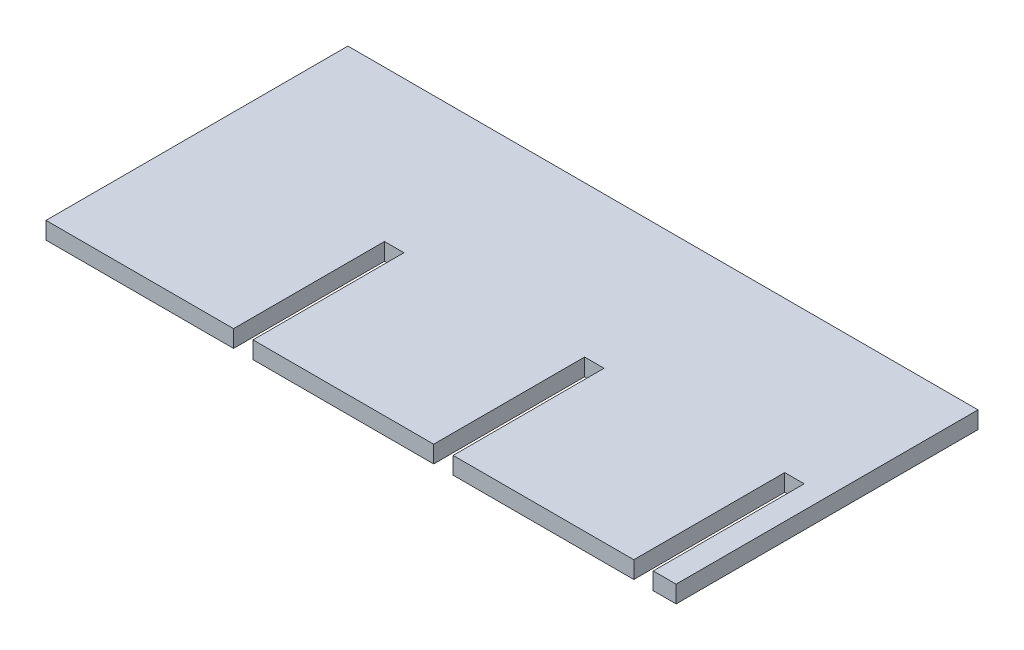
ISO-10303-21;
HEADER;
FILE_DESCRIPTION(('STEP AP214'),'2;1');
FILE_NAME('part.step','',(''),(''),'','','');
FILE_SCHEMA(('AUTOMOTIVE_DESIGN { 1 0 10303 214 1 1 1 1 }'));
ENDSEC;
DATA;
#1=APPLICATION_CONTEXT('core data for automotive mechanical design processes');
#2=APPLICATION_PROTOCOL_DEFINITION('international standard','automotive_design',2000,#1);
#3=PRODUCT_CONTEXT('',#1,'mechanical');
#4=PRODUCT('Part','Part','',(#3));
#5=PRODUCT_RELATED_PRODUCT_CATEGORY('part','',(#4));
#6=PRODUCT_DEFINITION_FORMATION('','',#4);
#7=PRODUCT_DEFINITION_CONTEXT('part definition',#1,'design');
#8=PRODUCT_DEFINITION('design','',#6,#7);
#9=PRODUCT_DEFINITION_SHAPE('','',#8);
#10=(LENGTH_UNIT() NAMED_UNIT(*) SI_UNIT(.MILLI.,.METRE.));
#11=(NAMED_UNIT(*) PLANE_ANGLE_UNIT() SI_UNIT($,.RADIAN.));
#12=(NAMED_UNIT(*) SI_UNIT($,.STERADIAN.) SOLID_ANGLE_UNIT());
#13=UNCERTAINTY_MEASURE_WITH_UNIT(LENGTH_MEASURE(1.E-05),#10,'distance_accuracy_value','');
#14=(GEOMETRIC_REPRESENTATION_CONTEXT(3) GLOBAL_UNCERTAINTY_ASSIGNED_CONTEXT((#13)) GLOBAL_UNIT_ASSIGNED_CONTEXT((#10,
#11,#12)) REPRESENTATION_CONTEXT('',''));
#15=CARTESIAN_POINT('',(0.,0.,0.));
#16=DIRECTION('',(0.,0.,1.));
#17=DIRECTION('',(1.,0.,0.));
#18=AXIS2_PLACEMENT_3D('',#15,#16,#17);
#19=CARTESIAN_POINT('',(0.,0.,26.4));
#20=DIRECTION('',(0.,0.,-1.));
#21=DIRECTION('',(-1.,0.,0.));
#22=AXIS2_PLACEMENT_3D('',#19,#20,#21);
#23=PLANE('',#22);
#24=DIRECTION('',(-1.,0.,0.));
#25=VECTOR('',#24,1.);
#26=CARTESIAN_POINT('',(-34.75,-19.25,26.4));
#27=LINE('',#26,#25);
#28=CARTESIAN_POINT('',(16.65,-19.25,26.4));
#29=VERTEX_POINT('',#28);
#30=CARTESIAN_POINT('',(0.849999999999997,-19.25,26.4));
#31=VERTEX_POINT('',#30);
#32=EDGE_CURVE('E223',#29,#31,#27,.T.);
#33=ORIENTED_EDGE('',*,*,#32,.T.);
#34=DIRECTION('',(0.,-1.,0.));
#35=VECTOR('',#34,1.);
#36=CARTESIAN_POINT('',(0.849999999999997,-5.94098050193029,26.4));
#37=LINE('',#36,#35);
#38=CARTESIAN_POINT('',(0.849999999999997,-20.75,26.4));
#39=VERTEX_POINT('',#38);
#40=EDGE_CURVE('E419',#31,#39,#37,.T.);
#41=ORIENTED_EDGE('',*,*,#40,.T.);
#42=DIRECTION('',(1.,0.,0.));
#43=VECTOR('',#42,1.);
#44=CARTESIAN_POINT('',(-34.75,-20.75,26.4));
#45=LINE('',#44,#43);
#46=CARTESIAN_POINT('',(16.65,-20.75,26.4));
#47=VERTEX_POINT('',#46);
#48=EDGE_CURVE('E169',#39,#47,#45,.T.);
#49=ORIENTED_EDGE('',*,*,#48,.T.);
#50=DIRECTION('',(0.,-1.,0.));
#51=VECTOR('',#50,1.);
#52=CARTESIAN_POINT('',(16.65,-5.94098050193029,26.4));
#53=LINE('',#52,#51);
#54=EDGE_CURVE('E398',#29,#47,#53,.T.);
#55=ORIENTED_EDGE('',*,*,#54,.F.);
#56=EDGE_LOOP('',(#33,#41,#49,#55));
#57=FACE_BOUND('',#56,.T.);
#58=ADVANCED_FACE('F34',(#57),#23,.F.);
#59=CARTESIAN_POINT('',(18.35,-20.75,26.4));
#60=VERTEX_POINT('',#59);
#61=CARTESIAN_POINT('',(20.35,-20.75,26.4));
#62=VERTEX_POINT('',#61);
#63=EDGE_CURVE('E160',#60,#62,#45,.T.);
#64=ORIENTED_EDGE('',*,*,#63,.T.);
#65=DIRECTION('',(0.,-1.,0.));
#66=VECTOR('',#65,1.);
#67=CARTESIAN_POINT('',(20.35,10.82191380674,26.4));
#68=LINE('',#67,#66);
#69=CARTESIAN_POINT('',(20.35,-19.25,26.4));
#70=VERTEX_POINT('',#69);
#71=EDGE_CURVE('E146',#70,#62,#68,.T.);
#72=ORIENTED_EDGE('',*,*,#71,.F.);
#73=CARTESIAN_POINT('',(18.35,-19.25,26.4));
#74=VERTEX_POINT('',#73);
#75=EDGE_CURVE('E174',#70,#74,#27,.T.);
#76=ORIENTED_EDGE('',*,*,#75,.T.);
#77=DIRECTION('',(0.,-1.,0.));
#78=VECTOR('',#77,1.);
#79=CARTESIAN_POINT('',(18.35,-5.94098050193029,26.4));
#80=LINE('',#79,#78);
#81=EDGE_CURVE('E168',#74,#60,#80,.T.);
#82=ORIENTED_EDGE('',*,*,#81,.T.);
#83=EDGE_LOOP('',(#64,#72,#76,#82));
#84=FACE_BOUND('',#83,.T.);
#85=ADVANCED_FACE('F166',(#84),#23,.F.);
#86=CARTESIAN_POINT('',(-16.65,-20.75,26.4));
#87=VERTEX_POINT('',#86);
#88=CARTESIAN_POINT('',(-0.850000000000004,-20.75,26.4));
#89=VERTEX_POINT('',#88);
#90=EDGE_CURVE('E172',#87,#89,#45,.T.);
#91=ORIENTED_EDGE('',*,*,#90,.T.);
#92=DIRECTION('',(0.,-1.,0.));
#93=VECTOR('',#92,1.);
#94=CARTESIAN_POINT('',(-0.850000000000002,-5.94098050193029,26.4));
#95=LINE('',#94,#93);
#96=CARTESIAN_POINT('',(-0.850000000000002,-19.25,26.4));
#97=VERTEX_POINT('',#96);
#98=EDGE_CURVE('E57',#97,#89,#95,.T.);
#99=ORIENTED_EDGE('',*,*,#98,.F.);
#100=CARTESIAN_POINT('',(-16.65,-19.25,26.4));
#101=VERTEX_POINT('',#100);
#102=EDGE_CURVE('E224',#97,#101,#27,.T.);
#103=ORIENTED_EDGE('',*,*,#102,.T.);
#104=DIRECTION('',(0.,-1.,0.));
#105=VECTOR('',#104,1.);
#106=CARTESIAN_POINT('',(-16.65,-5.94098050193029,26.4));
#107=LINE('',#106,#105);
#108=EDGE_CURVE('E215',#101,#87,#107,.T.);
#109=ORIENTED_EDGE('',*,*,#108,.T.);
#110=EDGE_LOOP('',(#91,#99,#103,#109));
#111=FACE_BOUND('',#110,.T.);
#112=ADVANCED_FACE('F234',(#111),#23,.F.);
#113=CARTESIAN_POINT('',(-34.75,-19.25,26.4));
#114=DIRECTION('',(0.,-1.,0.));
#115=DIRECTION('',(0.,0.,-1.));
#116=AXIS2_PLACEMENT_3D('',#113,#114,#115);
#117=PLANE('',#116);
#118=ORIENTED_EDGE('',*,*,#75,.F.);
#119=DIRECTION('',(0.,0.,1.));
#120=VECTOR('',#119,1.);
#121=CARTESIAN_POINT('',(20.35,-19.25,26.4));
#122=LINE('',#121,#120);
#123=CARTESIAN_POINT('',(20.35,-19.25,0.));
#124=VERTEX_POINT('',#123);
#125=EDGE_CURVE('E149',#124,#70,#122,.T.);
#126=ORIENTED_EDGE('',*,*,#125,.F.);
#127=DIRECTION('',(-1.,0.,0.));
#128=VECTOR('',#127,1.);
#129=CARTESIAN_POINT('',(-34.75,-19.25,0.));
#130=LINE('',#129,#128);
#131=CARTESIAN_POINT('',(-34.75,-19.25,0.));
#132=VERTEX_POINT('',#131);
#133=EDGE_CURVE('E190',#124,#132,#130,.T.);
#134=ORIENTED_EDGE('',*,*,#133,.T.);
#135=DIRECTION('',(0.,0.,-1.));
#136=VECTOR('',#135,1.);
#137=CARTESIAN_POINT('',(-34.75,-19.25,26.4));
#138=LINE('',#137,#136);
#139=CARTESIAN_POINT('',(-34.75,-19.25,26.4));
#140=VERTEX_POINT('',#139);
#141=EDGE_CURVE('E11',#140,#132,#138,.T.);
#142=ORIENTED_EDGE('',*,*,#141,.F.);
#143=CARTESIAN_POINT('',(-18.35,-19.25,26.4));
#144=VERTEX_POINT('',#143);
#145=EDGE_CURVE('E188',#144,#140,#27,.T.);
#146=ORIENTED_EDGE('',*,*,#145,.F.);
#147=DIRECTION('',(0.,0.,1.));
#148=VECTOR('',#147,1.);
#149=CARTESIAN_POINT('',(-18.35,-19.25,13.2));
#150=LINE('',#149,#148);
#151=CARTESIAN_POINT('',(-18.35,-19.25,13.2));
#152=VERTEX_POINT('',#151);
#153=EDGE_CURVE('E202',#152,#144,#150,.T.);
#154=ORIENTED_EDGE('',*,*,#153,.F.);
#155=DIRECTION('',(-1.,0.,0.));
#156=VECTOR('',#155,1.);
#157=CARTESIAN_POINT('',(-18.35,-19.25,13.2));
#158=LINE('',#157,#156);
#159=CARTESIAN_POINT('',(-16.65,-19.25,13.2));
#160=VERTEX_POINT('',#159);
#161=EDGE_CURVE('E196',#160,#152,#158,.T.);
#162=ORIENTED_EDGE('',*,*,#161,.F.);
#163=DIRECTION('',(0.,0.,-1.));
#164=VECTOR('',#163,1.);
#165=CARTESIAN_POINT('',(-16.65,-19.25,13.2));
#166=LINE('',#165,#164);
#167=EDGE_CURVE('E191',#101,#160,#166,.T.);
#168=ORIENTED_EDGE('',*,*,#167,.F.);
#169=ORIENTED_EDGE('',*,*,#102,.F.);
#170=DIRECTION('',(0.,0.,1.));
#171=VECTOR('',#170,1.);
#172=CARTESIAN_POINT('',(-0.850000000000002,-19.25,26.4));
#173=LINE('',#172,#171);
#174=CARTESIAN_POINT('',(-0.85,-19.25,13.2));
#175=VERTEX_POINT('',#174);
#176=EDGE_CURVE('E428',#175,#97,#173,.T.);
#177=ORIENTED_EDGE('',*,*,#176,.F.);
#178=DIRECTION('',(-1.,0.,0.));
#179=VECTOR('',#178,1.);
#180=CARTESIAN_POINT('',(0.85,-19.25,13.2));
#181=LINE('',#180,#179);
#182=CARTESIAN_POINT('',(0.85,-19.25,13.2));
#183=VERTEX_POINT('',#182);
#184=EDGE_CURVE('E436',#183,#175,#181,.T.);
#185=ORIENTED_EDGE('',*,*,#184,.F.);
#186=DIRECTION('',(0.,0.,-1.));
#187=VECTOR('',#186,1.);
#188=CARTESIAN_POINT('',(0.849999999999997,-19.25,26.4));
#189=LINE('',#188,#187);
#190=EDGE_CURVE('E414',#31,#183,#189,.T.);
#191=ORIENTED_EDGE('',*,*,#190,.F.);
#192=ORIENTED_EDGE('',*,*,#32,.F.);
#193=DIRECTION('',(0.,0.,1.));
#194=VECTOR('',#193,1.);
#195=CARTESIAN_POINT('',(16.65,-19.25,26.4));
#196=LINE('',#195,#194);
#197=CARTESIAN_POINT('',(16.65,-19.25,13.2));
#198=VERTEX_POINT('',#197);
#199=EDGE_CURVE('E406',#198,#29,#196,.T.);
#200=ORIENTED_EDGE('',*,*,#199,.F.);
#201=DIRECTION('',(-1.,0.,0.));
#202=VECTOR('',#201,1.);
#203=CARTESIAN_POINT('',(18.35,-19.25,13.2));
#204=LINE('',#203,#202);
#205=CARTESIAN_POINT('',(18.35,-19.25,13.2));
#206=VERTEX_POINT('',#205);
#207=EDGE_CURVE('E416',#206,#198,#204,.T.);
#208=ORIENTED_EDGE('',*,*,#207,.F.);
#209=DIRECTION('',(0.,0.,-1.));
#210=VECTOR('',#209,1.);
#211=CARTESIAN_POINT('',(18.35,-19.25,26.4));
#212=LINE('',#211,#210);
#213=EDGE_CURVE('E209',#74,#206,#212,.T.);
#214=ORIENTED_EDGE('',*,*,#213,.F.);
#215=EDGE_LOOP('',(#118,#126,#134,#142,#146,#154,#162,#168,#169,#177,#185,#191,#192,#200,#208,#214));
#216=FACE_BOUND('',#215,.T.);
#217=ADVANCED_FACE('F36',(#216),#117,.F.);
#218=CARTESIAN_POINT('',(-34.75,-19.25,26.4));
#219=DIRECTION('',(1.,0.,0.));
#220=DIRECTION('',(0.,0.,-1.));
#221=AXIS2_PLACEMENT_3D('',#218,#219,#220);
#222=PLANE('',#221);
#223=DIRECTION('',(0.,-1.,0.));
#224=VECTOR('',#223,1.);
#225=CARTESIAN_POINT('',(-34.75,-19.25,0.));
#226=LINE('',#225,#224);
#227=CARTESIAN_POINT('',(-34.75,-20.75,0.));
#228=VERTEX_POINT('',#227);
#229=EDGE_CURVE('E189',#132,#228,#226,.T.);
#230=ORIENTED_EDGE('',*,*,#229,.T.);
#231=DIRECTION('',(0.,0.,-1.));
#232=VECTOR('',#231,1.);
#233=CARTESIAN_POINT('',(-34.75,-20.75,26.4));
#234=LINE('',#233,#232);
#235=CARTESIAN_POINT('',(-34.75,-20.75,26.4));
#236=VERTEX_POINT('',#235);
#237=EDGE_CURVE('E42',#236,#228,#234,.T.);
#238=ORIENTED_EDGE('',*,*,#237,.F.);
#239=DIRECTION('',(0.,-1.,0.));
#240=VECTOR('',#239,1.);
#241=CARTESIAN_POINT('',(-34.75,-19.25,26.4));
#242=LINE('',#241,#240);
#243=EDGE_CURVE('E170',#140,#236,#242,.T.);
#244=ORIENTED_EDGE('',*,*,#243,.F.);
#245=ORIENTED_EDGE('',*,*,#141,.T.);
#246=EDGE_LOOP('',(#230,#238,#244,#245));
#247=FACE_BOUND('',#246,.T.);
#248=ADVANCED_FACE('F231',(#247),#222,.F.);
#249=CARTESIAN_POINT('',(-34.75,-20.75,26.4));
#250=DIRECTION('',(0.,1.,0.));
#251=DIRECTION('',(0.,0.,1.));
#252=AXIS2_PLACEMENT_3D('',#249,#250,#251);
#253=PLANE('',#252);
#254=DIRECTION('',(1.,0.,0.));
#255=VECTOR('',#254,1.);
#256=CARTESIAN_POINT('',(-34.75,-20.75,0.));
#257=LINE('',#256,#255);
#258=CARTESIAN_POINT('',(20.35,-20.75,0.));
#259=VERTEX_POINT('',#258);
#260=EDGE_CURVE('E163',#228,#259,#257,.T.);
#261=ORIENTED_EDGE('',*,*,#260,.T.);
#262=DIRECTION('',(0.,0.,-1.));
#263=VECTOR('',#262,1.);
#264=CARTESIAN_POINT('',(20.35,-20.75,26.4));
#265=LINE('',#264,#263);
#266=EDGE_CURVE('E49',#62,#259,#265,.T.);
#267=ORIENTED_EDGE('',*,*,#266,.F.);
#268=ORIENTED_EDGE('',*,*,#63,.F.);
#269=DIRECTION('',(0.,0.,1.));
#270=VECTOR('',#269,1.);
#271=CARTESIAN_POINT('',(18.35,-20.75,26.4));
#272=LINE('',#271,#270);
#273=CARTESIAN_POINT('',(18.35,-20.75,13.2));
#274=VERTEX_POINT('',#273);
#275=EDGE_CURVE('E412',#274,#60,#272,.T.);
#276=ORIENTED_EDGE('',*,*,#275,.F.);
#277=DIRECTION('',(1.,0.,0.));
#278=VECTOR('',#277,1.);
#279=CARTESIAN_POINT('',(18.35,-20.75,13.2));
#280=LINE('',#279,#278);
#281=CARTESIAN_POINT('',(16.65,-20.75,13.2));
#282=VERTEX_POINT('',#281);
#283=EDGE_CURVE('E399',#282,#274,#280,.T.);
#284=ORIENTED_EDGE('',*,*,#283,.F.);
#285=DIRECTION('',(0.,0.,-1.));
#286=VECTOR('',#285,1.);
#287=CARTESIAN_POINT('',(16.65,-20.75,26.4));
#288=LINE('',#287,#286);
#289=EDGE_CURVE('E409',#47,#282,#288,.T.);
#290=ORIENTED_EDGE('',*,*,#289,.F.);
#291=ORIENTED_EDGE('',*,*,#48,.F.);
#292=DIRECTION('',(0.,0.,1.));
#293=VECTOR('',#292,1.);
#294=CARTESIAN_POINT('',(0.849999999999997,-20.75,26.4));
#295=LINE('',#294,#293);
#296=CARTESIAN_POINT('',(0.85,-20.75,13.2));
#297=VERTEX_POINT('',#296);
#298=EDGE_CURVE('E433',#297,#39,#295,.T.);
#299=ORIENTED_EDGE('',*,*,#298,.F.);
#300=DIRECTION('',(1.,0.,0.));
#301=VECTOR('',#300,1.);
#302=CARTESIAN_POINT('',(0.85,-20.75,13.2));
#303=LINE('',#302,#301);
#304=CARTESIAN_POINT('',(-0.85,-20.75,13.2));
#305=VERTEX_POINT('',#304);
#306=EDGE_CURVE('E422',#305,#297,#303,.T.);
#307=ORIENTED_EDGE('',*,*,#306,.F.);
#308=DIRECTION('',(0.,0.,-1.));
#309=VECTOR('',#308,1.);
#310=CARTESIAN_POINT('',(-0.850000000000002,-20.75,26.4));
#311=LINE('',#310,#309);
#312=EDGE_CURVE('E431',#89,#305,#311,.T.);
#313=ORIENTED_EDGE('',*,*,#312,.F.);
#314=ORIENTED_EDGE('',*,*,#90,.F.);
#315=DIRECTION('',(0.,0.,1.));
#316=VECTOR('',#315,1.);
#317=CARTESIAN_POINT('',(-16.65,-20.75,13.2));
#318=LINE('',#317,#316);
#319=CARTESIAN_POINT('',(-16.65,-20.75,13.2));
#320=VERTEX_POINT('',#319);
#321=EDGE_CURVE('E206',#320,#87,#318,.T.);
#322=ORIENTED_EDGE('',*,*,#321,.F.);
#323=DIRECTION('',(1.,0.,0.));
#324=VECTOR('',#323,1.);
#325=CARTESIAN_POINT('',(-18.35,-20.75,13.2));
#326=LINE('',#325,#324);
#327=CARTESIAN_POINT('',(-18.35,-20.75,13.2));
#328=VERTEX_POINT('',#327);
#329=EDGE_CURVE('E212',#328,#320,#326,.T.);
#330=ORIENTED_EDGE('',*,*,#329,.F.);
#331=DIRECTION('',(0.,0.,-1.));
#332=VECTOR('',#331,1.);
#333=CARTESIAN_POINT('',(-18.35,-20.75,13.2));
#334=LINE('',#333,#332);
#335=CARTESIAN_POINT('',(-18.35,-20.75,26.4));
#336=VERTEX_POINT('',#335);
#337=EDGE_CURVE('E208',#336,#328,#334,.T.);
#338=ORIENTED_EDGE('',*,*,#337,.F.);
#339=EDGE_CURVE('E173',#236,#336,#45,.T.);
#340=ORIENTED_EDGE('',*,*,#339,.F.);
#341=ORIENTED_EDGE('',*,*,#237,.T.);
#342=EDGE_LOOP('',(#261,#267,#268,#276,#284,#290,#291,#299,#307,#313,#314,#322,#330,#338,#340,#341));
#343=FACE_BOUND('',#342,.T.);
#344=ADVANCED_FACE('F158',(#343),#253,.F.);
#345=ORIENTED_EDGE('',*,*,#339,.T.);
#346=DIRECTION('',(0.,-1.,0.));
#347=VECTOR('',#346,1.);
#348=CARTESIAN_POINT('',(-18.35,-5.94098050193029,26.4));
#349=LINE('',#348,#347);
#350=EDGE_CURVE('E220',#144,#336,#349,.T.);
#351=ORIENTED_EDGE('',*,*,#350,.F.);
#352=ORIENTED_EDGE('',*,*,#145,.T.);
#353=ORIENTED_EDGE('',*,*,#243,.T.);
#354=EDGE_LOOP('',(#345,#351,#352,#353));
#355=FACE_BOUND('',#354,.T.);
#356=ADVANCED_FACE('F228',(#355),#23,.F.);
#357=CARTESIAN_POINT('',(0.,0.,0.));
#358=DIRECTION('',(0.,0.,-1.));
#359=DIRECTION('',(-1.,0.,0.));
#360=AXIS2_PLACEMENT_3D('',#357,#358,#359);
#361=PLANE('',#360);
#362=DIRECTION('',(0.,-1.,0.));
#363=VECTOR('',#362,1.);
#364=CARTESIAN_POINT('',(20.35,10.82191380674,0.));
#365=LINE('',#364,#363);
#366=EDGE_CURVE('E153',#124,#259,#365,.T.);
#367=ORIENTED_EDGE('',*,*,#366,.T.);
#368=ORIENTED_EDGE('',*,*,#260,.F.);
#369=ORIENTED_EDGE('',*,*,#229,.F.);
#370=ORIENTED_EDGE('',*,*,#133,.F.);
#371=EDGE_LOOP('',(#367,#368,#369,#370));
#372=FACE_BOUND('',#371,.T.);
#373=ADVANCED_FACE('F250',(#372),#361,.T.);
#374=CARTESIAN_POINT('',(-16.65,-5.94098050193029,13.2));
#375=DIRECTION('',(1.,0.,0.));
#376=DIRECTION('',(0.,0.,-1.));
#377=AXIS2_PLACEMENT_3D('',#374,#375,#376);
#378=PLANE('',#377);
#379=ORIENTED_EDGE('',*,*,#167,.T.);
#380=DIRECTION('',(0.,-1.,0.));
#381=VECTOR('',#380,1.);
#382=CARTESIAN_POINT('',(-16.65,-5.94098050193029,13.2));
#383=LINE('',#382,#381);
#384=EDGE_CURVE('E216',#160,#320,#383,.T.);
#385=ORIENTED_EDGE('',*,*,#384,.T.);
#386=ORIENTED_EDGE('',*,*,#321,.T.);
#387=ORIENTED_EDGE('',*,*,#108,.F.);
#388=EDGE_LOOP('',(#379,#385,#386,#387));
#389=FACE_BOUND('',#388,.T.);
#390=ADVANCED_FACE('F256',(#389),#378,.F.);
#391=CARTESIAN_POINT('',(-18.35,-5.94098050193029,13.2));
#392=DIRECTION('',(0.,0.,-1.));
#393=DIRECTION('',(-1.,0.,0.));
#394=AXIS2_PLACEMENT_3D('',#391,#392,#393);
#395=PLANE('',#394);
#396=ORIENTED_EDGE('',*,*,#161,.T.);
#397=DIRECTION('',(0.,-1.,0.));
#398=VECTOR('',#397,1.);
#399=CARTESIAN_POINT('',(-18.35,-5.94098050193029,13.2));
#400=LINE('',#399,#398);
#401=EDGE_CURVE('E218',#152,#328,#400,.T.);
#402=ORIENTED_EDGE('',*,*,#401,.T.);
#403=ORIENTED_EDGE('',*,*,#329,.T.);
#404=ORIENTED_EDGE('',*,*,#384,.F.);
#405=EDGE_LOOP('',(#396,#402,#403,#404));
#406=FACE_BOUND('',#405,.T.);
#407=ADVANCED_FACE('F326',(#406),#395,.F.);
#408=CARTESIAN_POINT('',(-18.35,-5.94098050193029,13.2));
#409=DIRECTION('',(-1.,0.,0.));
#410=DIRECTION('',(0.,0.,1.));
#411=AXIS2_PLACEMENT_3D('',#408,#409,#410);
#412=PLANE('',#411);
#413=ORIENTED_EDGE('',*,*,#153,.T.);
#414=ORIENTED_EDGE('',*,*,#350,.T.);
#415=ORIENTED_EDGE('',*,*,#337,.T.);
#416=ORIENTED_EDGE('',*,*,#401,.F.);
#417=EDGE_LOOP('',(#413,#414,#415,#416));
#418=FACE_BOUND('',#417,.T.);
#419=ADVANCED_FACE('F318',(#418),#412,.F.);
#420=CARTESIAN_POINT('',(18.35,-5.94098050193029,26.4));
#421=DIRECTION('',(1.,0.,0.));
#422=DIRECTION('',(0.,0.,-1.));
#423=AXIS2_PLACEMENT_3D('',#420,#421,#422);
#424=PLANE('',#423);
#425=ORIENTED_EDGE('',*,*,#213,.T.);
#426=DIRECTION('',(0.,-1.,0.));
#427=VECTOR('',#426,1.);
#428=CARTESIAN_POINT('',(18.35,-5.94098050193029,13.2));
#429=LINE('',#428,#427);
#430=EDGE_CURVE('E404',#206,#274,#429,.T.);
#431=ORIENTED_EDGE('',*,*,#430,.T.);
#432=ORIENTED_EDGE('',*,*,#275,.T.);
#433=ORIENTED_EDGE('',*,*,#81,.F.);
#434=EDGE_LOOP('',(#425,#431,#432,#433));
#435=FACE_BOUND('',#434,.T.);
#436=ADVANCED_FACE('F310',(#435),#424,.F.);
#437=CARTESIAN_POINT('',(18.35,-5.94098050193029,13.2));
#438=DIRECTION('',(0.,0.,-1.));
#439=DIRECTION('',(-1.,0.,0.));
#440=AXIS2_PLACEMENT_3D('',#437,#438,#439);
#441=PLANE('',#440);
#442=ORIENTED_EDGE('',*,*,#207,.T.);
#443=DIRECTION('',(0.,-1.,0.));
#444=VECTOR('',#443,1.);
#445=CARTESIAN_POINT('',(16.65,-5.94098050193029,13.2));
#446=LINE('',#445,#444);
#447=EDGE_CURVE('E402',#198,#282,#446,.T.);
#448=ORIENTED_EDGE('',*,*,#447,.T.);
#449=ORIENTED_EDGE('',*,*,#283,.T.);
#450=ORIENTED_EDGE('',*,*,#430,.F.);
#451=EDGE_LOOP('',(#442,#448,#449,#450));
#452=FACE_BOUND('',#451,.T.);
#453=ADVANCED_FACE('F302',(#452),#441,.F.);
#454=CARTESIAN_POINT('',(16.65,-5.94098050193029,26.4));
#455=DIRECTION('',(-1.,0.,0.));
#456=DIRECTION('',(0.,0.,1.));
#457=AXIS2_PLACEMENT_3D('',#454,#455,#456);
#458=PLANE('',#457);
#459=ORIENTED_EDGE('',*,*,#199,.T.);
#460=ORIENTED_EDGE('',*,*,#54,.T.);
#461=ORIENTED_EDGE('',*,*,#289,.T.);
#462=ORIENTED_EDGE('',*,*,#447,.F.);
#463=EDGE_LOOP('',(#459,#460,#461,#462));
#464=FACE_BOUND('',#463,.T.);
#465=ADVANCED_FACE('F294',(#464),#458,.F.);
#466=CARTESIAN_POINT('',(0.849999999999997,-5.94098050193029,26.4));
#467=DIRECTION('',(1.,0.,0.));
#468=DIRECTION('',(0.,0.,-1.));
#469=AXIS2_PLACEMENT_3D('',#466,#467,#468);
#470=PLANE('',#469);
#471=ORIENTED_EDGE('',*,*,#190,.T.);
#472=DIRECTION('',(0.,-1.,0.));
#473=VECTOR('',#472,1.);
#474=CARTESIAN_POINT('',(0.85,-5.94098050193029,13.2));
#475=LINE('',#474,#473);
#476=EDGE_CURVE('E426',#183,#297,#475,.T.);
#477=ORIENTED_EDGE('',*,*,#476,.T.);
#478=ORIENTED_EDGE('',*,*,#298,.T.);
#479=ORIENTED_EDGE('',*,*,#40,.F.);
#480=EDGE_LOOP('',(#471,#477,#478,#479));
#481=FACE_BOUND('',#480,.T.);
#482=ADVANCED_FACE('F286',(#481),#470,.F.);
#483=CARTESIAN_POINT('',(0.85,-5.94098050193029,13.2));
#484=DIRECTION('',(0.,0.,-1.));
#485=DIRECTION('',(-1.,0.,0.));
#486=AXIS2_PLACEMENT_3D('',#483,#484,#485);
#487=PLANE('',#486);
#488=ORIENTED_EDGE('',*,*,#184,.T.);
#489=DIRECTION('',(0.,-1.,0.));
#490=VECTOR('',#489,1.);
#491=CARTESIAN_POINT('',(-0.85,-5.94098050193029,13.2));
#492=LINE('',#491,#490);
#493=EDGE_CURVE('E424',#175,#305,#492,.T.);
#494=ORIENTED_EDGE('',*,*,#493,.T.);
#495=ORIENTED_EDGE('',*,*,#306,.T.);
#496=ORIENTED_EDGE('',*,*,#476,.F.);
#497=EDGE_LOOP('',(#488,#494,#495,#496));
#498=FACE_BOUND('',#497,.T.);
#499=ADVANCED_FACE('F280',(#498),#487,.F.);
#500=CARTESIAN_POINT('',(-0.850000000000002,-5.94098050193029,26.4));
#501=DIRECTION('',(-1.,0.,0.));
#502=DIRECTION('',(0.,0.,1.));
#503=AXIS2_PLACEMENT_3D('',#500,#501,#502);
#504=PLANE('',#503);
#505=ORIENTED_EDGE('',*,*,#176,.T.);
#506=ORIENTED_EDGE('',*,*,#98,.T.);
#507=ORIENTED_EDGE('',*,*,#312,.T.);
#508=ORIENTED_EDGE('',*,*,#493,.F.);
#509=EDGE_LOOP('',(#505,#506,#507,#508));
#510=FACE_BOUND('',#509,.T.);
#511=ADVANCED_FACE('F270',(#510),#504,.F.);
#512=CARTESIAN_POINT('',(20.35,10.82191380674,26.4));
#513=DIRECTION('',(-1.,0.,0.));
#514=DIRECTION('',(0.,0.,1.));
#515=AXIS2_PLACEMENT_3D('',#512,#513,#514);
#516=PLANE('',#515);
#517=ORIENTED_EDGE('',*,*,#125,.T.);
#518=ORIENTED_EDGE('',*,*,#71,.T.);
#519=ORIENTED_EDGE('',*,*,#266,.T.);
#520=ORIENTED_EDGE('',*,*,#366,.F.);
#521=EDGE_LOOP('',(#517,#518,#519,#520));
#522=FACE_BOUND('',#521,.T.);
#523=ADVANCED_FACE('F147',(#522),#516,.F.);
#524=CLOSED_SHELL('',(#58,#85,#112,#217,#248,#344,#356,#373,#390,#407,#419,#436,#453,#465,#482,
#499,#511,#523));
#525=MANIFOLD_SOLID_BREP('B2',#524);
#526=ADVANCED_BREP_SHAPE_REPRESENTATION('',(#18,#525),#14);
#527=SHAPE_DEFINITION_REPRESENTATION(#9,#526);
ENDSEC;
END-ISO-10303-21;
